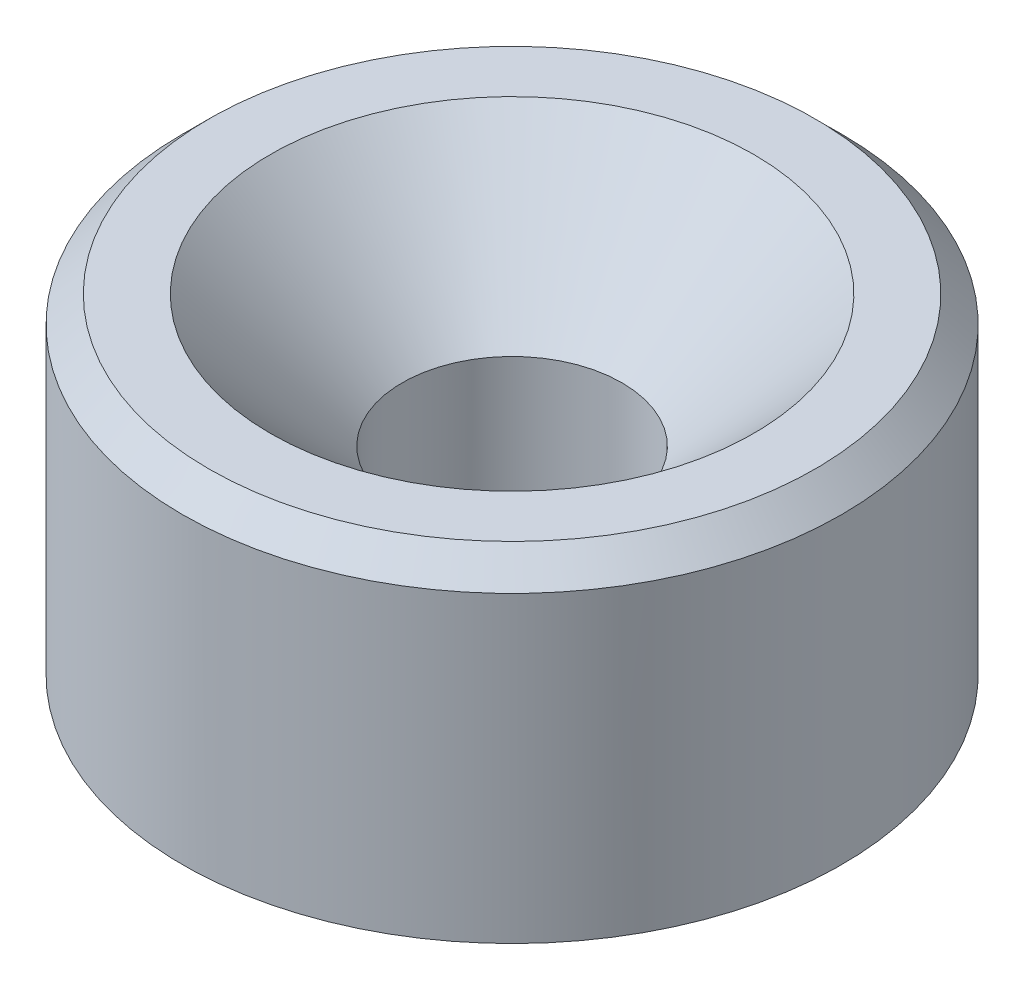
from build123d import *

# Parameters (mm, degrees)
SKETCH4_R          = 3.175
CUT_EXTRUDE1_DEPTH = 17.497783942
CHAMFER1_SIZE      = 0.762


with BuildPart() as part:
    # Sketch3 → Revolve1 (revolve)
    with BuildSketch(Plane.XY, mode=Mode.PRIVATE) as revolve1_sk:
        Polygon((0, 0), (0, 2.54), (6.985, 9.525), (9.525, 9.525), (9.525, 0), align=None)
    revolve(revolve1_sk.sketch.rotate(Axis((0, 0, 0), (0, 1, 0)), 90), axis=Axis((0, 0, 0), (0, 1, 0)))

    # Sketch4 → Cut-Extrude1 (cut, through all)
    with BuildSketch(Plane.XZ):
        with Locations(Location((0, 0, 0), (0, 0, 270))):
            Circle(SKETCH4_R)
    extrude(amount=-CUT_EXTRUDE1_DEPTH, mode=Mode.SUBTRACT)

    # Chamfer1
    chamfer1_edges = [part.edges().sort_by_distance(p)[0] for p in [
        (0, 9.525, 9.525),
    ]]
    chamfer(chamfer1_edges, length=CHAMFER1_SIZE)


solid = part.part
